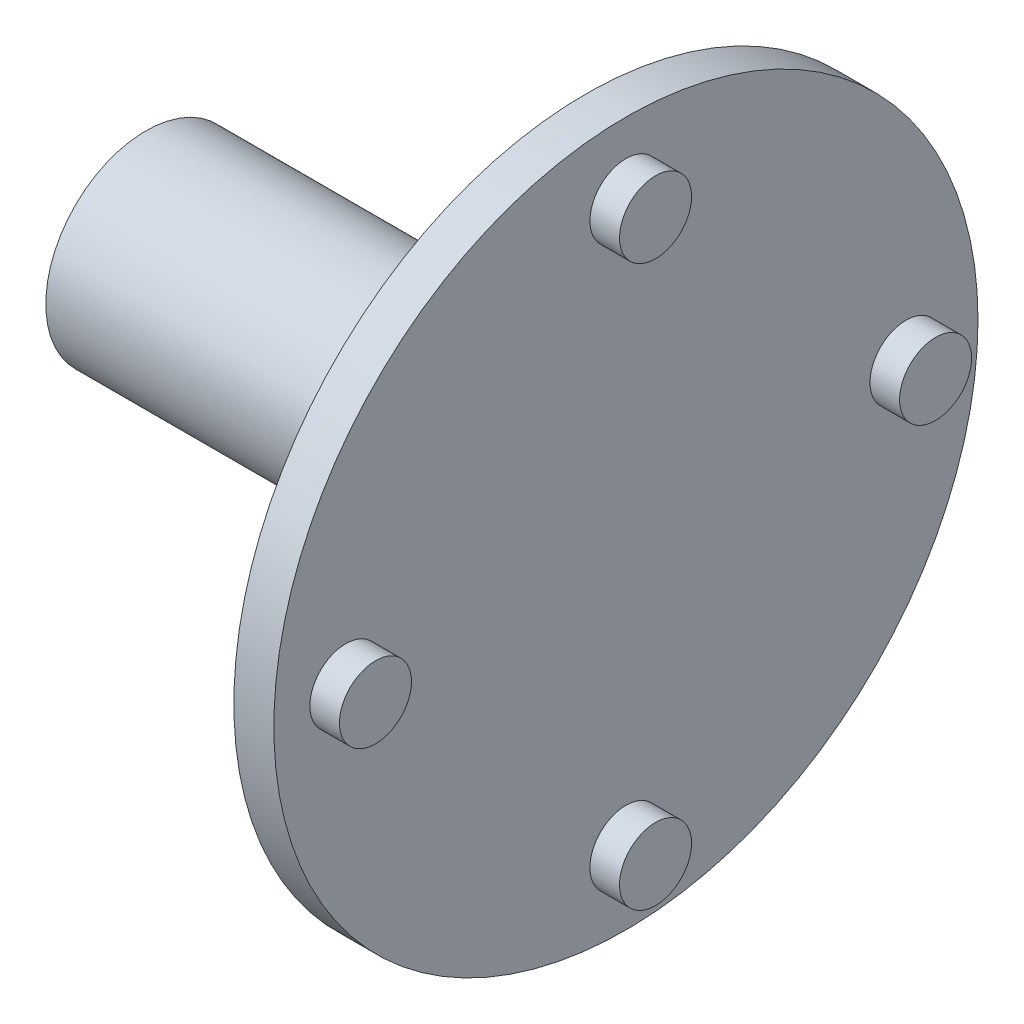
from build123d import *

# Parameters (mm, degrees)
SKETCH3_R             = 12.5
BOSS_EXTRUDE1_DEPTH   = 60
SKETCH2_R             = 44
BOSS_EXTRUDE2_DEPTH   = 5
SKETCH1_R             = 4.5
BOSS_EXTRUDE3_DEPTH   = 2
BOSS_EXTRUDE3_2_DEPTH = 2
BOSS_EXTRUDE3_3_DEPTH = 2
BOSS_EXTRUDE3_4_DEPTH = 2


with BuildPart() as part:
    # Sketch3 → Boss-Extrude1 (new body)
    with BuildSketch(Plane(origin=(-1.7, 0, 0), x_dir=(0, 0, -1), z_dir=(1, 0, 0))):
        Circle(SKETCH3_R)
    extrude(amount=-BOSS_EXTRUDE1_DEPTH)

    # Sketch2 → Boss-Extrude2 (add)
    with BuildSketch(Plane(origin=(-1.7, 0, 0), x_dir=(0, 0, -1), z_dir=(1, 0, 0))):
        Circle(SKETCH2_R)
    extrude(amount=-BOSS_EXTRUDE2_DEPTH)


with BuildPart() as body_2:
    # Sketch1 → Boss-Extrude3 (new, symmetric)
    with BuildSketch(Plane(origin=(0, 0, 0), x_dir=(0, 0, -1), z_dir=(1, 0, 0))):
        with Locations((0, 35)):
            Circle(SKETCH1_R)
    extrude(amount=BOSS_EXTRUDE3_DEPTH, both=True)


with BuildPart() as body_3:
    # Sketch1 → Boss-Extrude3 2 (new, symmetric)
    with BuildSketch(Plane(origin=(0, 0, 0), x_dir=(0, 0, -1), z_dir=(1, 0, 0))):
        with Locations((35, 0)):
            Circle(SKETCH1_R)
    extrude(amount=BOSS_EXTRUDE3_2_DEPTH, both=True)


with BuildPart() as body_4:
    # Sketch1 → Boss-Extrude3 3 (new, symmetric)
    with BuildSketch(Plane(origin=(0, 0, 0), x_dir=(0, 0, -1), z_dir=(1, 0, 0))):
        with Locations((0, -35)):
            Circle(SKETCH1_R)
    extrude(amount=BOSS_EXTRUDE3_3_DEPTH, both=True)


with BuildPart() as body_5:
    # Sketch1 → Boss-Extrude3 4 (new, symmetric)
    with BuildSketch(Plane(origin=(0, 0, 0), x_dir=(0, 0, -1), z_dir=(1, 0, 0))):
        with Locations((-35, 0)):
            Circle(SKETCH1_R)
    extrude(amount=BOSS_EXTRUDE3_4_DEPTH, both=True)


solid = Compound([part.part, body_2.part, body_3.part, body_4.part, body_5.part])
